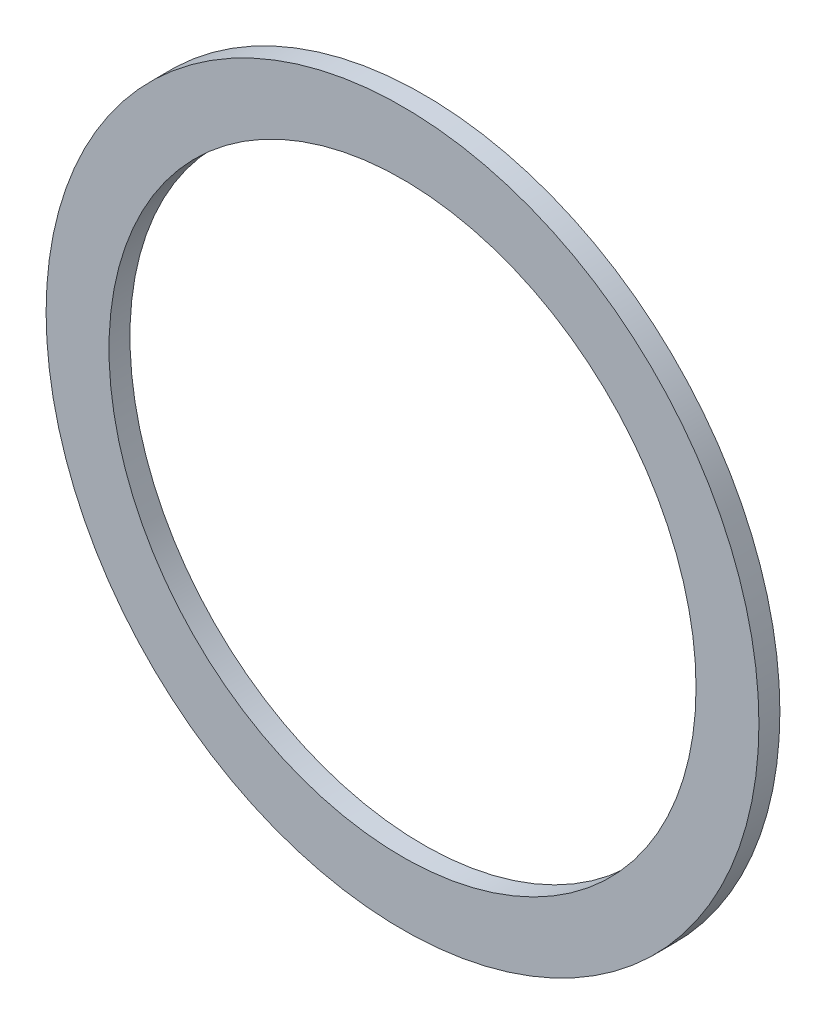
from build123d import *

# Parameters (mm, degrees)
SKETCH1_R      = 26.9875
SKETCH1_R_2    = 22.225
EXTRUDE1_DEPTH = 1.5875


with BuildPart() as part:
    # Sketch1 → Extrude1 (new body)
    with BuildSketch(Plane.XY):
        Circle(SKETCH1_R)
        Circle(SKETCH1_R_2, mode=Mode.SUBTRACT)
    extrude(amount=EXTRUDE1_DEPTH)


solid = part.part
